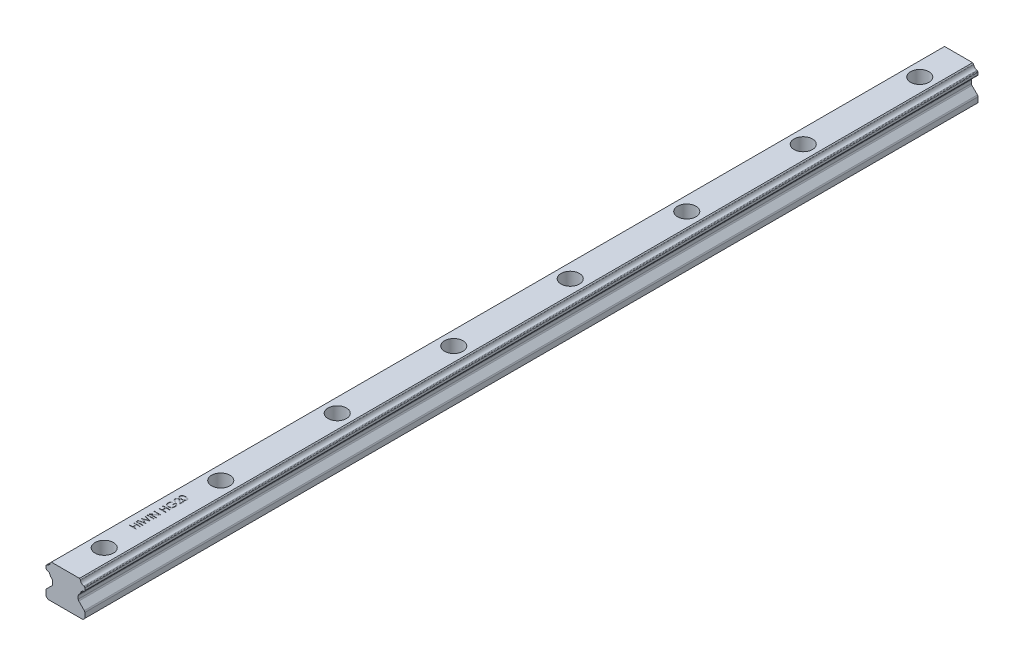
from build123d import *

# Parameters (mm, degrees)
EXTRUDE_1_DEPTH              = 460
HOLE_WIZARD_M5_1_D           = 6
HOLE_WIZARD_M5_1_CBORE_D     = 9.5
HOLE_WIZARD_M5_1_CBORE_DEPTH = 8.5
PATTERN_LINEAR_1_COUNT       = 8
PATTERN_LINEAR_1_PITCH       = 60
SKETCH_6_W                   = 3.5
SKETCH_6_H                   = 0.314102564
CUT_EXTRUDE_1_DEPTH          = 0.1


with BuildPart() as part:
    # Sketch 1 → Extrude 1 (new body)
    with BuildSketch(Plane.XY):
        with BuildLine():
            Line((-10, 3.656507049), (-10, 1))
            Line((-10, 1), (-9, 0))
            Line((-9, 0), (9, 0))
            Line((9, 0), (10, 1))
            Line((10, 1), (10, 3.656507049))
            ThreePointArc((10, 3.656507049), (9.923879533, 4.039190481), (9.707106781, 4.36361383))
            Line((9.707106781, 4.36361383), (6.892893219, 7.177827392))
            ThreePointArc((6.892893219, 7.177827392), (6.676120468, 7.502250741), (6.6, 7.884934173))
            Line((6.6, 7.884934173), (6.6, 9.445065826))
            ThreePointArc((6.6, 9.445065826), (6.676120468, 9.827749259), (6.892893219, 10.152172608))
            Line((6.892893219, 10.152172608), (7.645433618, 10.904713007))
            ThreePointArc((7.645433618, 10.904713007), (7.734505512, 11.025709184), (7.783610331, 11.167704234))
            ThreePointArc((7.783610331, 11.167704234), (8.344607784, 12.235448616), (9.412352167, 12.79644607))
            ThreePointArc((9.412352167, 12.79644607), (9.554347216, 12.845550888), (9.675343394, 12.934622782))
            Line((9.675343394, 12.934622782), (9.853553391, 13.112832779))
            ThreePointArc((9.853553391, 13.112832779), (9.961939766, 13.275044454), (10, 13.46638617))
            Line((10, 13.46638617), (10, 14.52361383))
            ThreePointArc((10, 14.52361383), (9.961939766, 14.714955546), (9.853553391, 14.877167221))
            Line((9.853553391, 14.877167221), (9.663348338, 15.067372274))
            ThreePointArc((9.663348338, 15.067372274), (9.543418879, 15.155882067), (9.402727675, 15.205106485))
            ThreePointArc((9.402727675, 15.205106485), (8.344607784, 15.764307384), (7.785406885, 16.822427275))
            ThreePointArc((7.785406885, 16.822427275), (7.736182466, 16.963118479), (7.647672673, 17.083047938))
            Line((7.647672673, 17.083047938), (7.230720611, 17.5))
            Line((7.230720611, 17.5), (-7.230720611, 17.5))
            Line((-7.230720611, 17.5), (-7.647672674, 17.083047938))
            ThreePointArc((-7.647672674, 17.083047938), (-7.736182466, 16.963118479), (-7.785406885, 16.822427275))
            ThreePointArc((-7.785406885, 16.822427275), (-8.344607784, 15.764307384), (-9.402727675, 15.205106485))
            ThreePointArc((-9.402727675, 15.205106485), (-9.543418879, 15.155882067), (-9.663348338, 15.067372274))
            Line((-9.663348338, 15.067372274), (-9.853553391, 14.877167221))
            ThreePointArc((-9.853553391, 14.877167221), (-9.961939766, 14.714955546), (-10, 14.52361383))
            Line((-10, 14.52361383), (-10, 13.46638617))
            ThreePointArc((-10, 13.46638617), (-9.961939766, 13.275044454), (-9.853553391, 13.112832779))
            Line((-9.853553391, 13.112832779), (-9.675343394, 12.934622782))
            ThreePointArc((-9.675343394, 12.934622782), (-9.554347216, 12.845550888), (-9.412352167, 12.79644607))
            ThreePointArc((-9.412352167, 12.79644607), (-8.344607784, 12.235448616), (-7.783610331, 11.167704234))
            ThreePointArc((-7.783610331, 11.167704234), (-7.734505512, 11.025709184), (-7.645433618, 10.904713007))
            Line((-7.645433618, 10.904713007), (-6.892893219, 10.152172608))
            ThreePointArc((-6.892893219, 10.152172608), (-6.676120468, 9.827749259), (-6.6, 9.445065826))
            Line((-6.6, 9.445065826), (-6.6, 7.884934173))
            ThreePointArc((-6.6, 7.884934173), (-6.676120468, 7.502250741), (-6.892893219, 7.177827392))
            Line((-6.892893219, 7.177827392), (-9.707106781, 4.36361383))
            ThreePointArc((-9.707106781, 4.36361383), (-9.923879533, 4.039190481), (-10, 3.656507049))
        make_face()
    extrude(amount=-EXTRUDE_1_DEPTH)

    # Hole Wizard M5 _1 (through all)
    with Locations(Plane(origin=(-0.295893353, 17.5, -3.104602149), x_dir=(-1, 0, 0), z_dir=(0, 1, 0))):
        with Locations((-0.295893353, -16.895397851)):
            hole_wizard_m5_1 = CounterBoreHole(HOLE_WIZARD_M5_1_D / 2, HOLE_WIZARD_M5_1_CBORE_D / 2, HOLE_WIZARD_M5_1_CBORE_DEPTH)

    # Pattern Linear 1: Hole Wizard M5 _1 ×8
    with Locations(*[(0, 0, -i * PATTERN_LINEAR_1_PITCH) for i in range(1, PATTERN_LINEAR_1_COUNT)]):
        add(hole_wizard_m5_1, mode=Mode.SUBTRACT)

    # Sketch 6 → Cut-Extrude 1 (cut)
    # profile 1 of 9: a face of its own
    with BuildSketch(Plane(origin=(0, 17.5, 0), x_dir=(1, 0, 0), z_dir=(0, 1, 0))):
        Polygon((-3.5, 36.403846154), (-3.5, 36.717948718), (-2.064102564, 36.717948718), (-2.064102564, 38.512820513), (-3.5, 38.512820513), (-3.5, 38.826923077), (0, 38.826923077), (0, 38.512820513), (-1.705128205, 38.512820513), (-1.705128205, 36.717948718), (0, 36.717948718), (0, 36.403846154), align=None)
    # profile 2 of 9: a face of its own
    with BuildSketch(Plane(origin=(0, 17.5, 0), x_dir=(1, 0, 0), z_dir=(0, 1, 0))):
        with Locations((-1.75, 39.881410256)):
            Rectangle(SKETCH_6_W, SKETCH_6_H)
    # profile 3 of 9: a face of its own
    with BuildSketch(Plane(origin=(0, 17.5, 0), x_dir=(1, 0, 0), z_dir=(0, 1, 0))):
        Polygon((-3.5, 40.576923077), (-3.5, 40.901542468), (-0.933193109, 41.586538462), (-3.5, 42.605268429), (-3.5, 42.650841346), (-0.950721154, 43.650641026), (-3.5, 44.339142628), (-3.5, 44.66025641), (0, 43.716546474), (0, 43.671674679), (-2.676883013, 42.618589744), (0, 41.552884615), (0, 41.508012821), align=None)
    # profile 4 of 9: a face of its own
    with BuildSketch(Plane(origin=(0, 17.5, 0), x_dir=(1, 0, 0), z_dir=(0, 1, 0))):
        with Locations((-1.75, 45.625)):
            Rectangle(SKETCH_6_W, SKETCH_6_H)
    # profile 5 of 9: a face of its own
    with BuildSketch(Plane(origin=(0, 17.5, 0), x_dir=(1, 0, 0), z_dir=(0, 1, 0))):
        Polygon((0, 46.544871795), (-3.5, 46.544871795), (-3.5, 46.610777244), (-0.745292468, 48.923076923), (-3.5, 48.923076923), (-3.5, 49.237179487), (0, 49.237179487), (0, 49.165665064), (-2.748397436, 46.858974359), (0, 46.858974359), align=None)
    # profile 6 of 9: a face of its own
    with BuildSketch(Plane(origin=(0, 17.5, 0), x_dir=(1, 0, 0), z_dir=(0, 1, 0))):
        Polygon((-3.5, 51.480769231), (-3.5, 51.794871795), (-2.064102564, 51.794871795), (-2.064102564, 53.58974359), (-3.5, 53.58974359), (-3.5, 53.903846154), (0, 53.903846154), (0, 53.58974359), (-1.705128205, 53.58974359), (-1.705128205, 51.794871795), (0, 51.794871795), (0, 51.480769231), align=None)
    # profile 7 of 9: a face of its own
    with BuildSketch(Plane(origin=(0, 17.5, 0), x_dir=(1, 0, 0), z_dir=(0, 1, 0))):
        with BuildLine():
            Line((-2.902644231, 58.076923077), (-2.647435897, 57.807692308))
            add(Edge.make_bspline(
                [(-2.647435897, 57.807692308), (-2.69328212, 57.758983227), (-2.783881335, 57.662726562), (-2.901244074, 57.50552662), (-3.002777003, 57.342170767), (-3.084772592, 57.172394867), (-3.149094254, 57.000650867), (-3.195850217, 56.829891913), (-3.225460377, 56.661223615), (-3.229016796, 56.549059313), (-3.230769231, 56.493790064)],
                knots=[0, 0, 0, 0, 1.089067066, 2.152164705, 3.18986567, 4.218445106, 5.218487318, 6.173592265, 7.100032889, 8, 8, 8, 8], degree=3))
            add(Edge.make_bspline(
                [(-3.230769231, 56.493790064), (-3.230355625, 56.459875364), (-3.229529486, 56.392133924), (-3.218985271, 56.29151198), (-3.203820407, 56.191945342), (-3.181878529, 56.093621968), (-3.15406947, 55.99635068), (-3.119284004, 55.900469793), (-3.078728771, 55.805800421), (-3.031866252, 55.713234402), (-2.980386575, 55.623493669), (-2.923337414, 55.538737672), (-2.862550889, 55.458421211), (-2.796491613, 55.384072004), (-2.725807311, 55.31519549), (-2.651770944, 55.250524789), (-2.572926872, 55.191265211), (-2.489599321, 55.138479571), (-2.403726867, 55.090811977), (-2.316037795, 55.049619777), (-2.227346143, 55.013809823), (-2.136984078, 54.986535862), (-2.045883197, 54.963434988), (-1.953566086, 54.947353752), (-1.859791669, 54.938257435), (-1.796993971, 54.936686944), (-1.765424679, 54.935897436)],
                knots=[0, 0, 0, 0, 1.028150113, 2.053633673, 3.06513288, 4.081487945, 5.106702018, 6.131327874, 7.172780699, 8.228344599, 9.276313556, 10.308389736, 11.324843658, 12.329040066, 13.321460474, 14.316307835, 15.308626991, 16.309440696, 17.305625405, 18.28535951, 19.246194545, 20.203493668, 21.145557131, 22.095268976, 23.042464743, 24, 24, 24, 24], degree=3))
            add(Edge.make_bspline(
                [(-1.765424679, 54.935897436), (-1.733154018, 54.936653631), (-1.668700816, 54.938163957), (-1.572504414, 54.947817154), (-1.477747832, 54.965772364), (-1.384282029, 54.989584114), (-1.291920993, 55.019856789), (-1.20076111, 55.057049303), (-1.110811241, 55.101355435), (-1.022964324, 55.152526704), (-0.937464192, 55.209036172), (-0.856251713, 55.271187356), (-0.780271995, 55.339084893), (-0.708415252, 55.411483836), (-0.641134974, 55.489043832), (-0.579242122, 55.572517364), (-0.521779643, 55.660735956), (-0.469378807, 55.753738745), (-0.42257144, 55.850542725), (-0.38094723, 55.949799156), (-0.346667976, 56.051827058), (-0.31872985, 56.156089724), (-0.295829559, 56.262463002), (-0.281097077, 56.371486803), (-0.270406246, 56.482359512), (-0.269624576, 56.557098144), (-0.269230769, 56.594751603)],
                knots=[0, 0, 0, 0, 0.935915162, 1.869274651, 2.799799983, 3.730201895, 4.664668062, 5.616159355, 6.583070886, 7.570012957, 8.562524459, 9.553461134, 10.53281078, 11.515274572, 12.509912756, 13.507571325, 14.526460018, 15.561318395, 16.601025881, 17.643204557, 18.680545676, 19.719612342, 20.772381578, 21.833430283, 22.908478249, 24, 24, 24, 24], degree=3))
            add(Edge.make_bspline(
                [(-0.269230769, 56.594751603), (-0.270178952, 56.640130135), (-0.272040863, 56.729238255), (-0.286546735, 56.860222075), (-0.309173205, 56.986034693), (-0.342412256, 57.106266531), (-0.384484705, 57.221353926), (-0.436513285, 57.330872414), (-0.497950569, 57.435124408), (-0.567552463, 57.533658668), (-0.645100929, 57.624132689), (-0.728035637, 57.706474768), (-0.817431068, 57.77785339), (-0.911954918, 57.840400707), (-1.012511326, 57.892097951), (-1.118540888, 57.934543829), (-1.230109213, 57.967076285), (-1.307200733, 57.980431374), (-1.346153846, 57.987179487)],
                knots=[0, 0, 0, 0, 1.130199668, 2.219330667, 3.279027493, 4.311506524, 5.322739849, 6.327972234, 7.327472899, 8.33386792, 9.329086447, 10.29244429, 11.240784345, 12.174119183, 13.111530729, 14.052100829, 15.015757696, 16, 16, 16, 16], degree=3))
            Line((-1.346153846, 57.987179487), (-1.346153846, 56.820512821))
            Line((-1.346153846, 56.820512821), (-1.705128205, 56.820512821))
            Line((-1.705128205, 56.820512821), (-1.705128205, 58.301282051))
            add(Edge.make_bspline(
                [(-1.705128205, 58.301282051), (-1.638220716, 58.299576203), (-1.507270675, 58.296237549), (-1.316300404, 58.272818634), (-1.13592871, 58.235002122), (-0.965965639, 58.18334181), (-0.806652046, 58.116466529), (-0.65782618, 58.035094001), (-0.520449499, 57.93792188), (-0.393400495, 57.828411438), (-0.280071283, 57.705511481), (-0.180465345, 57.572542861), (-0.09656273, 57.429285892), (-0.028302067, 57.275876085), (0.024971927, 57.112815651), (0.062743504, 56.939727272), (0.085373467, 56.756845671), (0.088264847, 56.631508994), (0.08974359, 56.567407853)],
                knots=[0, 0, 0, 0, 1.140356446, 2.231883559, 3.274166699, 4.278491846, 5.25512956, 6.21435461, 7.1637429, 8.11826594, 9.068280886, 10.0076534, 10.945064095, 11.891975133, 12.864533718, 13.863980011, 14.907571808, 16, 16, 16, 16], degree=3))
            add(Edge.make_bspline(
                [(0.08974359, 56.567407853), (0.089174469, 56.527897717), (0.088051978, 56.449970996), (0.080074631, 56.334880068), (0.067794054, 56.222962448), (0.049248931, 56.114234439), (0.026534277, 56.008296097), (-0.002552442, 55.905676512), (-0.036221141, 55.80598477), (-0.074516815, 55.709066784), (-0.118888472, 55.615802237), (-0.168198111, 55.52577572), (-0.222191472, 55.438489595), (-0.281802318, 55.35453843), (-0.346584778, 55.273484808), (-0.416668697, 55.195851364), (-0.491839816, 55.121203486), (-0.545218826, 55.074443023), (-0.572115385, 55.05088141)],
                knots=[0, 0, 0, 0, 1.107784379, 2.184907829, 3.233506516, 4.263428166, 5.276301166, 6.270063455, 7.25232949, 8.225834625, 9.190232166, 10.146266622, 11.1027726, 12.066435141, 13.031522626, 14.010570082, 14.99756817, 16, 16, 16, 16], degree=3))
            add(Edge.make_bspline(
                [(-0.572115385, 55.05088141), (-0.614786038, 55.016695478), (-0.699419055, 54.948891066), (-0.835018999, 54.861612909), (-0.975420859, 54.787211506), (-1.121015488, 54.726843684), (-1.271666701, 54.679705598), (-1.427181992, 54.645899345), (-1.587761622, 54.626092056), (-1.696426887, 54.623238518), (-1.751402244, 54.621794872)],
                knots=[0, 0, 0, 0, 1.023165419, 2.029347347, 3.013907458, 3.994755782, 4.975994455, 5.96558838, 6.970761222, 8, 8, 8, 8], degree=3))
            add(Edge.make_bspline(
                [(-1.751402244, 54.621794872), (-1.792568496, 54.62232711), (-1.874377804, 54.623384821), (-1.99583511, 54.636210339), (-2.115135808, 54.654611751), (-2.232182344, 54.681658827), (-2.347053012, 54.715755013), (-2.45980069, 54.758308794), (-2.570493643, 54.807852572), (-2.67836343, 54.865442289), (-2.782003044, 54.929511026), (-2.880905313, 54.999118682), (-2.973467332, 55.074802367), (-3.059903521, 55.156782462), (-3.141494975, 55.243406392), (-3.216537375, 55.336492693), (-3.286205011, 55.434631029), (-3.349159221, 55.538582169), (-3.405727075, 55.6467058), (-3.455315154, 55.758766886), (-3.496298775, 55.874724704), (-3.531072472, 55.993712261), (-3.556787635, 56.11662974), (-3.575436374, 56.242585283), (-3.588196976, 56.372235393), (-3.589223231, 56.459871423), (-3.58974359, 56.504306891)],
                knots=[0, 0, 0, 0, 1.00895651, 2.005089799, 2.991467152, 3.967318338, 4.948153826, 5.927364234, 6.919980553, 7.91976625, 8.923240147, 9.905815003, 10.88314567, 11.851989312, 12.825009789, 13.798721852, 14.781296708, 15.773896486, 16.776076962, 17.771600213, 18.775744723, 19.78957137, 20.808953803, 21.851964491, 22.910847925, 24, 24, 24, 24], degree=3))
            add(Edge.make_bspline(
                [(-3.58974359, 56.504306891), (-3.589164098, 56.540545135), (-3.588015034, 56.612401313), (-3.580050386, 56.719327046), (-3.567426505, 56.82460006), (-3.550199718, 56.92837645), (-3.526736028, 57.030302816), (-3.498657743, 57.130669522), (-3.46596592, 57.229622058), (-3.426977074, 57.326850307), (-3.382723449, 57.423008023), (-3.332910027, 57.518629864), (-3.276685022, 57.61338911), (-3.213881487, 57.707450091), (-3.145578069, 57.801405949), (-3.069821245, 57.893770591), (-2.989598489, 57.986773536), (-2.931916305, 58.04657535), (-2.902644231, 58.076923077)],
                knots=[0, 0, 0, 0, 0.985871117, 1.954866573, 2.915460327, 3.869826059, 4.81536089, 5.759505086, 6.70452669, 7.649098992, 8.607881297, 9.583363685, 10.581137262, 11.603961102, 12.659522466, 13.73993555, 14.853081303, 16, 16, 16, 16], degree=3))
        make_face()
    # profile 8 of 9: a face of its own
    with BuildSketch(Plane(origin=(0, 17.5, 0), x_dir=(1, 0, 0), z_dir=(0, 1, 0))):
        with BuildLine():
            Line((-2.423076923, 59.153846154), (-2.423076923, 58.83974359))
            add(Edge.make_bspline(
                [(-2.423076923, 58.83974359), (-2.464747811, 58.841790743), (-2.546588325, 58.845811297), (-2.665912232, 58.864639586), (-2.779967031, 58.891580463), (-2.887836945, 58.929671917), (-2.990475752, 58.976978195), (-3.087475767, 59.033708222), (-3.178466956, 59.100902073), (-3.262605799, 59.177108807), (-3.33979337, 59.259877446), (-3.406448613, 59.349183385), (-3.462766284, 59.443028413), (-3.509847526, 59.541127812), (-3.545187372, 59.644588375), (-3.571409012, 59.752471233), (-3.587185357, 59.86525037), (-3.588881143, 59.942090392), (-3.58974359, 59.981169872)],
                knots=[0, 0, 0, 0, 1.10065271, 2.161652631, 3.183658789, 4.190468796, 5.17591951, 6.163126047, 7.15150782, 8.156236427, 9.156009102, 10.134482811, 11.092018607, 12.041330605, 13.001268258, 13.972401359, 14.968799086, 16, 16, 16, 16], degree=3))
            add(Edge.make_bspline(
                [(-3.58974359, 59.981169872), (-3.588852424, 60.019550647), (-3.587101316, 60.094967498), (-3.571837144, 60.204991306), (-3.54844616, 60.309980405), (-3.513784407, 60.408744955), (-3.47029149, 60.502298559), (-3.416202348, 60.589482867), (-3.354076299, 60.672406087), (-3.280795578, 60.746998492), (-3.202604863, 60.815520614), (-3.119097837, 60.874582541), (-3.032749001, 60.925447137), (-2.942883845, 60.96707822), (-2.849209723, 60.998636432), (-2.752624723, 61.022018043), (-2.652014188, 61.035384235), (-2.583905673, 61.037424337), (-2.549278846, 61.038461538)],
                knots=[0, 0, 0, 0, 1.111674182, 2.184400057, 3.212814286, 4.223731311, 5.211378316, 6.196328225, 7.191884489, 8.207283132, 9.220262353, 10.201199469, 11.166417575, 12.120932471, 13.06540007, 14.026332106, 14.996573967, 16, 16, 16, 16], degree=3))
            add(Edge.make_bspline(
                [(-2.549278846, 61.038461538), (-2.500531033, 61.036768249), (-2.403890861, 61.033411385), (-2.26187569, 61.004697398), (-2.124283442, 60.959849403), (-2.013542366, 60.905856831), (-1.924317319, 60.851373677), (-1.850817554, 60.80232555), (-1.771698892, 60.744580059), (-1.686641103, 60.678630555), (-1.59675809, 60.603341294), (-1.500215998, 60.520668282), (-1.398799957, 60.428476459), (-1.329486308, 60.363827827), (-1.293569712, 60.330328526)],
                knots=[0, 0, 0, 0, 1.184416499, 2.348048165, 3.509039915, 4.696071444, 5.333504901, 6.05069495, 6.844171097, 7.714965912, 8.667477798, 9.695072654, 10.805644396, 12, 12, 12, 12], degree=3))
            Line((-1.293569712, 60.330328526), (-0.358974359, 59.454627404))
            Line((-0.358974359, 59.454627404), (-0.358974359, 61.083333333))
            Line((-0.358974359, 61.083333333), (0, 61.083333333))
            Line((0, 61.083333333), (0, 58.705128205))
            Line((0, 58.705128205), (-1.448517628, 60.0625))
            add(Edge.make_bspline(
                [(-1.448517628, 60.0625), (-1.483015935, 60.095547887), (-1.549280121, 60.159026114), (-1.646023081, 60.248808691), (-1.735772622, 60.329447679), (-1.818359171, 60.401465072), (-1.894990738, 60.463298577), (-1.963185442, 60.518170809), (-2.025939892, 60.5621364), (-2.098680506, 60.609851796), (-2.187492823, 60.656065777), (-2.296026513, 60.695778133), (-2.407753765, 60.719992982), (-2.483255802, 60.722897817), (-2.521233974, 60.724358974)],
                knots=[0, 0, 0, 0, 1.329631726, 2.553950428, 3.673215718, 4.687767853, 5.603093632, 6.413772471, 7.123043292, 7.734684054, 8.834405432, 9.900288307, 10.943827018, 12, 12, 12, 12], degree=3))
            add(Edge.make_bspline(
                [(-2.521233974, 60.724358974), (-2.545115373, 60.723723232), (-2.592181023, 60.722470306), (-2.661186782, 60.711412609), (-2.727751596, 60.694702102), (-2.792080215, 60.670756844), (-2.853525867, 60.639150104), (-2.912163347, 60.600676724), (-2.968852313, 60.556286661), (-3.022005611, 60.504935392), (-3.070686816, 60.448523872), (-3.113810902, 60.388929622), (-3.149850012, 60.325879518), (-3.179393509, 60.259639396), (-3.202568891, 60.190393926), (-3.21862747, 60.118009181), (-3.228709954, 60.042685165), (-3.230074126, 59.991251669), (-3.230769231, 59.965044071)],
                knots=[0, 0, 0, 0, 0.991446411, 1.95395049, 2.89581595, 3.838931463, 4.798493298, 5.75982156, 6.748411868, 7.785213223, 8.824556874, 9.840280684, 10.836137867, 11.835679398, 12.848801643, 13.863922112, 14.911575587, 16, 16, 16, 16], degree=3))
            add(Edge.make_bspline(
                [(-3.230769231, 59.965044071), (-3.230082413, 59.937666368), (-3.228733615, 59.88390108), (-3.218517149, 59.80512929), (-3.203028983, 59.72946555), (-3.178430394, 59.65803883), (-3.149365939, 59.589302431), (-3.11244268, 59.524723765), (-3.069537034, 59.46323063), (-3.019786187, 59.405834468), (-2.963887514, 59.353413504), (-2.902283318, 59.306707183), (-2.835417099, 59.266166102), (-2.76356329, 59.230744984), (-2.686006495, 59.20199263), (-2.603039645, 59.180018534), (-2.515018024, 59.162631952), (-2.454232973, 59.156823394), (-2.423076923, 59.153846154)],
                knots=[0, 0, 0, 0, 1.030878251, 2.024474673, 2.987898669, 3.934362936, 4.864849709, 5.795128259, 6.730474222, 7.685293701, 8.650606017, 9.611896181, 10.591709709, 11.591680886, 12.625074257, 13.701333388, 14.821793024, 16, 16, 16, 16], degree=3))
        make_face()
    # profile 9 of 9: a face of its own
    with BuildSketch(Plane(origin=(0, 17.5, 0), x_dir=(1, 0, 0), z_dir=(0, 1, 0))):
        with BuildLine():
            add(Edge.make_bspline(
                [(-1.748597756, 61.397435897), (-1.804695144, 61.397763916), (-1.913665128, 61.398401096), (-2.07244977, 61.405489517), (-2.22141006, 61.417264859), (-2.360553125, 61.433402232), (-2.489914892, 61.45304021), (-2.609149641, 61.479255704), (-2.718809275, 61.509068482), (-2.819251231, 61.543621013), (-2.911829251, 61.582608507), (-2.998253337, 61.625043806), (-3.078399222, 61.672604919), (-3.153522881, 61.722594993), (-3.222476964, 61.776960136), (-3.286055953, 61.834534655), (-3.343723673, 61.89647005), (-3.395519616, 61.962165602), (-3.4409371, 62.031176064), (-3.481188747, 62.101615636), (-3.514343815, 62.174742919), (-3.541465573, 62.249595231), (-3.56360569, 62.326330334), (-3.578813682, 62.404928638), (-3.588365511, 62.485572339), (-3.589279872, 62.540003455), (-3.58974359, 62.567608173)],
                knots=[0, 0, 0, 0, 1.646148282, 3.197666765, 4.66315463, 6.030252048, 7.307778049, 8.501004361, 9.610818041, 10.641065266, 11.615491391, 12.557119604, 13.464013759, 14.348536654, 15.203310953, 16.038349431, 16.863300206, 17.683791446, 18.490318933, 19.285717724, 20.06220424, 20.843281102, 21.620494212, 22.403315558, 23.190242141, 24, 24, 24, 24], degree=3))
            add(Edge.make_bspline(
                [(-3.58974359, 62.567608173), (-3.58935734, 62.595457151), (-3.588588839, 62.650866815), (-3.57777172, 62.732491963), (-3.563809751, 62.812695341), (-3.541417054, 62.890260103), (-3.514621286, 62.966652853), (-3.479264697, 63.039973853), (-3.440811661, 63.112811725), (-3.393902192, 63.18185754), (-3.342059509, 63.249174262), (-3.283204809, 63.31227666), (-3.218966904, 63.372777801), (-3.1479131, 63.42839258), (-3.071132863, 63.481504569), (-2.987982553, 63.530097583), (-2.898646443, 63.575182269), (-2.803538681, 63.617606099), (-2.700118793, 63.654704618), (-2.589031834, 63.687688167), (-2.46927186, 63.714723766), (-2.341506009, 63.737081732), (-2.20510133, 63.754435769), (-2.060334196, 63.767065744), (-1.907114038, 63.773739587), (-1.802356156, 63.774996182), (-1.748597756, 63.775641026)],
                knots=[0, 0, 0, 0, 0.810910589, 1.61342667, 2.396193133, 3.181089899, 3.963115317, 4.752255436, 5.550715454, 6.36105385, 7.181178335, 8.024612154, 8.872680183, 9.750181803, 10.651284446, 11.591556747, 12.554036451, 13.566402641, 14.62422919, 15.753422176, 16.94128843, 18.199818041, 19.531985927, 20.947085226, 22.433341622, 24, 24, 24, 24], degree=3))
            add(Edge.make_bspline(
                [(-1.748597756, 63.775641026), (-1.695074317, 63.774981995), (-1.590552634, 63.773695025), (-1.438014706, 63.767208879), (-1.294027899, 63.754127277), (-1.1584387, 63.738002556), (-1.031184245, 63.715394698), (-0.912347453, 63.688154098), (-0.801507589, 63.657117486), (-0.699458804, 63.619449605), (-0.604516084, 63.578013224), (-0.515836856, 63.532976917), (-0.432708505, 63.484658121), (-0.355725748, 63.432342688), (-0.284957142, 63.375813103), (-0.220498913, 63.315354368), (-0.161269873, 63.251701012), (-0.108856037, 63.183991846), (-0.061589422, 63.114302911), (-0.021740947, 63.041457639), (0.012785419, 62.967320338), (0.041013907, 62.891150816), (0.06290543, 62.813066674), (0.07795466, 62.732808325), (0.088533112, 62.650855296), (0.0893387, 62.595453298), (0.08974359, 62.567608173)],
                knots=[0, 0, 0, 0, 1.561645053, 3.049612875, 4.452756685, 5.778837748, 7.032101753, 8.221335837, 9.334924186, 10.387562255, 11.392109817, 12.355697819, 13.287721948, 14.19548756, 15.068665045, 15.927346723, 16.771751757, 17.602390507, 18.423119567, 19.225778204, 20.022010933, 20.807278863, 21.593079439, 22.384715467, 23.188155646, 24, 24, 24, 24], degree=3))
            add(Edge.make_bspline(
                [(0.08974359, 62.567608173), (0.089277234, 62.540004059), (0.088357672, 62.485574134), (0.078843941, 62.404921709), (0.063548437, 62.326639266), (0.042131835, 62.250340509), (0.015916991, 62.175634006), (-0.018236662, 62.103537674), (-0.057570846, 62.033250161), (-0.10236583, 61.964957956), (-0.153689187, 61.899948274), (-0.210447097, 61.837840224), (-0.274095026, 61.780251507), (-0.343630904, 61.726357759), (-0.418866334, 61.6758392), (-0.499851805, 61.628689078), (-0.586725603, 61.585363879), (-0.680035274, 61.545710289), (-0.781190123, 61.510552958), (-0.891129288, 61.47961794), (-1.010969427, 61.45491109), (-1.140102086, 61.433968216), (-1.278789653, 61.417186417), (-1.427082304, 61.405494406), (-1.584698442, 61.398406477), (-1.692967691, 61.397765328), (-1.748597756, 61.397435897)],
                knots=[0, 0, 0, 0, 0.810927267, 1.598990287, 2.382942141, 3.152806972, 3.926217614, 4.706701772, 5.493896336, 6.292070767, 7.104102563, 7.925577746, 8.761822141, 9.623241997, 10.509042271, 11.423174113, 12.375371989, 13.360203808, 14.400680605, 15.520553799, 16.714061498, 17.994519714, 19.364400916, 20.818312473, 22.365209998, 24, 24, 24, 24], degree=3))
        make_face()
        with BuildLine():
            add(Edge.make_bspline(
                [(-1.75, 61.711538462), (-1.703251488, 61.711660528), (-1.612521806, 61.711897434), (-1.480908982, 61.717907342), (-1.357947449, 61.72627252), (-1.243685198, 61.736796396), (-1.138521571, 61.752557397), (-1.042019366, 61.770439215), (-0.954357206, 61.791887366), (-0.874769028, 61.817389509), (-0.802127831, 61.846438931), (-0.73449747, 61.878100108), (-0.6710764, 61.912414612), (-0.612018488, 61.950085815), (-0.558045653, 61.991858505), (-0.507789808, 62.035796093), (-0.462998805, 62.083877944), (-0.409270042, 62.150378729), (-0.353751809, 62.2381766), (-0.305405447, 62.348796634), (-0.275023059, 62.46246519), (-0.271159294, 62.539616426), (-0.269230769, 62.578125)],
                knots=[0, 0, 0, 0, 1.459098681, 2.831824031, 4.11146945, 5.306290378, 6.412266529, 7.42953815, 8.369053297, 9.227277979, 10.03601793, 10.809473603, 11.557037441, 12.285528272, 12.993193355, 13.685654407, 14.36688038, 15.041354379, 16.352855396, 17.594313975, 18.799247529, 20, 20, 20, 20], degree=3))
            add(Edge.make_bspline(
                [(-0.269230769, 62.578125), (-0.270919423, 62.616856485), (-0.274290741, 62.694182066), (-0.303714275, 62.807746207), (-0.351547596, 62.917082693), (-0.406196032, 63.003369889), (-0.458572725, 63.068833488), (-0.503177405, 63.115754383), (-0.553136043, 63.158815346), (-0.607034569, 63.199657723), (-0.665907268, 63.237116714), (-0.729469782, 63.271179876), (-0.797898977, 63.302263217), (-0.845668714, 63.319972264), (-0.870092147, 63.329026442)],
                knots=[0, 0, 0, 0, 1.353621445, 2.702441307, 4.075953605, 5.516772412, 6.261413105, 7.007624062, 7.778524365, 8.566925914, 9.372323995, 10.217594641, 11.088702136, 12, 12, 12, 12], degree=3))
            add(Edge.make_bspline(
                [(-0.870092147, 63.329026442), (-0.901321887, 63.33957821), (-0.964731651, 63.361002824), (-1.063095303, 63.388614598), (-1.166298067, 63.410359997), (-1.273723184, 63.429923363), (-1.386162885, 63.443276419), (-1.503269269, 63.454024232), (-1.625130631, 63.460354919), (-1.707925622, 63.46113967), (-1.75, 63.461538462)],
                knots=[0, 0, 0, 0, 0.884706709, 1.796334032, 2.740027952, 3.714592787, 4.726048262, 5.777819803, 6.87074269, 8, 8, 8, 8], degree=3))
            add(Edge.make_bspline(
                [(-1.75, 63.461538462), (-1.792067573, 63.460988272), (-1.874360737, 63.459911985), (-1.994878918, 63.455797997), (-2.109346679, 63.445174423), (-2.218257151, 63.433375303), (-2.321007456, 63.415978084), (-2.418457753, 63.397220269), (-2.509400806, 63.372019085), (-2.59526029, 63.345099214), (-2.675061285, 63.31428915), (-2.749173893, 63.280372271), (-2.817962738, 63.244154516), (-2.88121528, 63.204798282), (-2.939298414, 63.162851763), (-2.990875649, 63.116810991), (-3.038455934, 63.069599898), (-3.091796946, 63.002455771), (-3.146613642, 62.915267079), (-3.19568703, 62.806026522), (-3.224729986, 62.692967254), (-3.228757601, 62.61637815), (-3.230769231, 62.578125)],
                knots=[0, 0, 0, 0, 1.313483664, 2.569454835, 3.763100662, 4.901599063, 5.988328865, 7.015709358, 7.99797933, 8.932480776, 9.824041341, 10.666387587, 11.475829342, 12.24921787, 12.990555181, 13.709176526, 14.405678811, 15.080244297, 16.38186033, 17.610124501, 18.806354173, 20, 20, 20, 20], degree=3))
            add(Edge.make_bspline(
                [(-3.230769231, 62.578125), (-3.228752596, 62.539408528), (-3.224715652, 62.46190505), (-3.195821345, 62.347638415), (-3.146757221, 62.237659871), (-3.091902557, 62.150183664), (-3.038660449, 62.083855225), (-2.993345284, 62.03678701), (-2.944289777, 61.992240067), (-2.889838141, 61.951549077), (-2.830988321, 61.914101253), (-2.768387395, 61.878460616), (-2.700630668, 61.847222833), (-2.628046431, 61.818080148), (-2.548453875, 61.792535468), (-2.460474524, 61.771332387), (-2.363741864, 61.752029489), (-2.257809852, 61.738128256), (-2.143523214, 61.725887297), (-2.020247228, 61.717999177), (-1.888182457, 61.711869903), (-1.796983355, 61.711651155), (-1.75, 61.711538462)],
                knots=[0, 0, 0, 0, 1.207546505, 2.417292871, 3.651582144, 4.952510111, 5.626719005, 6.30238548, 6.989136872, 7.692112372, 8.420316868, 9.164734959, 9.937886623, 10.746308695, 11.604196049, 12.543341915, 13.568754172, 14.680483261, 15.875568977, 17.154711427, 18.534182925, 20, 20, 20, 20], degree=3))
        make_face(mode=Mode.SUBTRACT)
    extrude(amount=-CUT_EXTRUDE_1_DEPTH, mode=Mode.SUBTRACT)


solid = part.part
